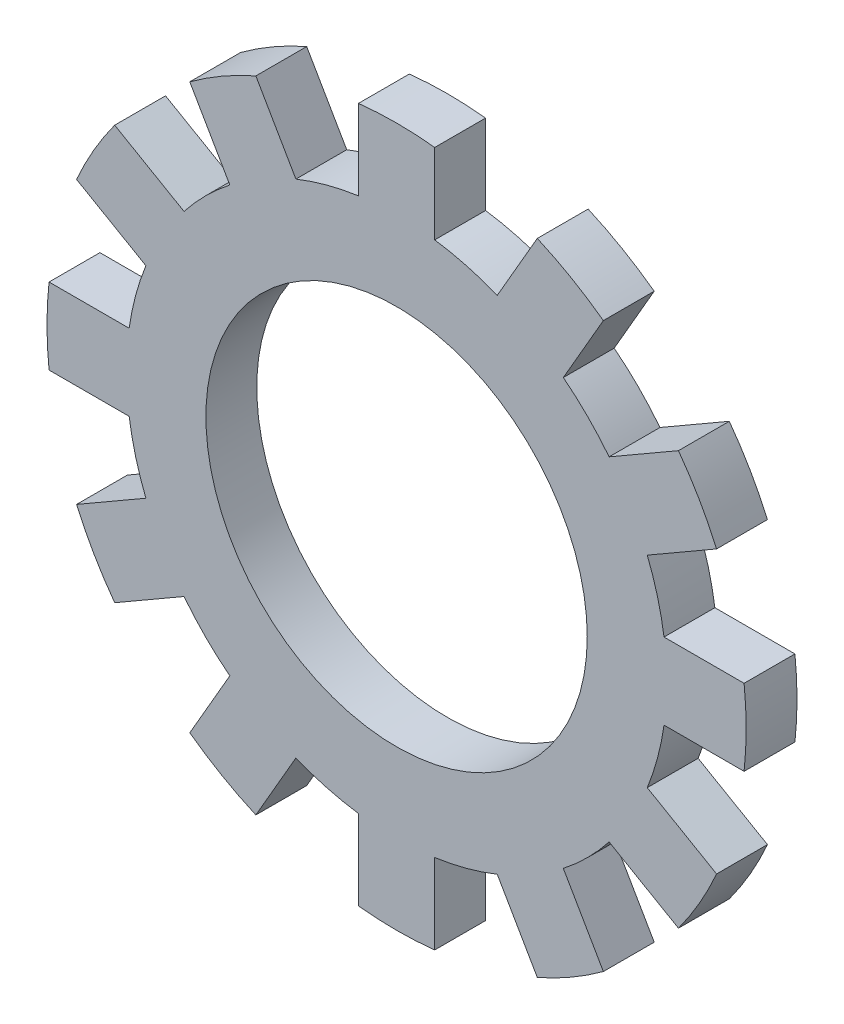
from build123d import *

# Parameters (mm, degrees)
SKETCH1_R                 = 2.125
SKETCH1_R_2               = 1.5
BOSS_EXTRUDE1_DEPTH       = 0.2
BOSS_EXTRUDE2_DEPTH       = 0.2
CIRPATTERN2_COUNT         = 12
CIRPATTERN2_COPY_1_DEPTH  = 0.2
CIRPATTERN2_COPY_2_DEPTH  = 0.2
CIRPATTERN2_COPY_3_DEPTH  = 0.2
CIRPATTERN2_COPY_4_DEPTH  = 0.2
CIRPATTERN2_COPY_5_DEPTH  = 0.2
CIRPATTERN2_COPY_6_DEPTH  = 0.2
CIRPATTERN2_COPY_7_DEPTH  = 0.2
CIRPATTERN2_COPY_8_DEPTH  = 0.2
CIRPATTERN2_COPY_9_DEPTH  = 0.2
CIRPATTERN2_COPY_10_DEPTH = 0.2
CIRPATTERN2_COPY_11_DEPTH = 0.2


with BuildPart() as part:
    # Sketch1 → Boss-Extrude1 (new, symmetric)
    with BuildSketch(Plane.XY):
        Circle(SKETCH1_R)
        Circle(SKETCH1_R_2, mode=Mode.SUBTRACT)
    extrude(amount=BOSS_EXTRUDE1_DEPTH, both=True)

    # Sketch3 → Boss-Extrude2 (add, symmetric)
    with BuildSketch(Plane.XY):
        with BuildLine():
            Line((-0.3, 2.733587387), (-0.3, 2.103716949))
            ThreePointArc((-0.3, 2.103716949), (-0.150377, 2.119672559), (0, 2.125))
            Line((0, 2.125), (0, 2.75))
            ThreePointArc((0, 2.75), (-0.150224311, 2.745893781), (-0.3, 2.733587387))
        make_face()
    boss_extrude2 = extrude(amount=BOSS_EXTRUDE2_DEPTH, both=True)

    # Mirror1: Boss-Extrude2 across plane
    add(boss_extrude2.mirror(Plane(origin=(0, 0, 0), x_dir=(0, 0, 1), z_dir=(1, 0, 0))))

    # CirPattern2: Boss-Extrude2 ×12 about axis
    cirpattern2_axis = Axis((0, 0, 0), (0, 0, 1))
    for i in range(1, CIRPATTERN2_COUNT):
        add(boss_extrude2.rotate(cirpattern2_axis, i * 360 / CIRPATTERN2_COUNT))

    # CirPattern2 copy 1 sketch → CirPattern2 copy 1 (add, symmetric)
    with BuildSketch(Plane(origin=(0, 0, 0), x_dir=(-0.8660254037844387, -0.49999999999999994, 0), z_dir=(0, 0, 1))):
        with BuildLine():
            Line((-0.3, -2.733587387), (-0.3, -2.103716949))
            ThreePointArc((-0.3, -2.103716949), (-0.150377, -2.119672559), (0, -2.125))
            Line((0, -2.125), (0, -2.75))
            ThreePointArc((0, -2.75), (-0.150224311, -2.745893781), (-0.3, -2.733587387))
        make_face()
    extrude(amount=CIRPATTERN2_COPY_1_DEPTH, both=True)

    # CirPattern2 copy 2 sketch → CirPattern2 copy 2 (add, symmetric)
    with BuildSketch(Plane(origin=(0, 0, 0), x_dir=(-0.5000000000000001, -0.8660254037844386, 0), z_dir=(0, 0, 1))):
        with BuildLine():
            Line((-0.3, -2.733587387), (-0.3, -2.103716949))
            ThreePointArc((-0.3, -2.103716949), (-0.150377, -2.119672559), (0, -2.125))
            Line((0, -2.125), (0, -2.75))
            ThreePointArc((0, -2.75), (-0.150224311, -2.745893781), (-0.3, -2.733587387))
        make_face()
    extrude(amount=CIRPATTERN2_COPY_2_DEPTH, both=True)

    # CirPattern2 copy 3 sketch → CirPattern2 copy 3 (add, symmetric)
    with BuildSketch(Plane(origin=(0, 0, 0), x_dir=(0, -1, 0), z_dir=(0, 0, 1))):
        with BuildLine():
            Line((-0.3, -2.733587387), (-0.3, -2.103716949))
            ThreePointArc((-0.3, -2.103716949), (-0.150377, -2.119672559), (0, -2.125))
            Line((0, -2.125), (0, -2.75))
            ThreePointArc((0, -2.75), (-0.150224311, -2.745893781), (-0.3, -2.733587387))
        make_face()
    extrude(amount=CIRPATTERN2_COPY_3_DEPTH, both=True)

    # CirPattern2 copy 4 sketch → CirPattern2 copy 4 (add, symmetric)
    with BuildSketch(Plane(origin=(0, 0, 0), x_dir=(0.4999999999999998, -0.8660254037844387, 0), z_dir=(0, 0, 1))):
        with BuildLine():
            Line((-0.3, -2.733587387), (-0.3, -2.103716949))
            ThreePointArc((-0.3, -2.103716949), (-0.150377, -2.119672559), (0, -2.125))
            Line((0, -2.125), (0, -2.75))
            ThreePointArc((0, -2.75), (-0.150224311, -2.745893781), (-0.3, -2.733587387))
        make_face()
    extrude(amount=CIRPATTERN2_COPY_4_DEPTH, both=True)

    # CirPattern2 copy 5 sketch → CirPattern2 copy 5 (add, symmetric)
    with BuildSketch(Plane(origin=(0, 0, 0), x_dir=(0.8660254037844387, -0.49999999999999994, 0), z_dir=(0, 0, 1))):
        with BuildLine():
            Line((-0.3, -2.733587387), (-0.3, -2.103716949))
            ThreePointArc((-0.3, -2.103716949), (-0.150377, -2.119672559), (0, -2.125))
            Line((0, -2.125), (0, -2.75))
            ThreePointArc((0, -2.75), (-0.150224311, -2.745893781), (-0.3, -2.733587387))
        make_face()
    extrude(amount=CIRPATTERN2_COPY_5_DEPTH, both=True)

    # CirPattern2 copy 6 sketch → CirPattern2 copy 6 (add, symmetric)
    with BuildSketch(Plane.XY):
        with BuildLine():
            Line((-0.3, -2.733587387), (-0.3, -2.103716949))
            ThreePointArc((-0.3, -2.103716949), (-0.150377, -2.119672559), (0, -2.125))
            Line((0, -2.125), (0, -2.75))
            ThreePointArc((0, -2.75), (-0.150224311, -2.745893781), (-0.3, -2.733587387))
        make_face()
    extrude(amount=CIRPATTERN2_COPY_6_DEPTH, both=True)

    # CirPattern2 copy 7 sketch → CirPattern2 copy 7 (add, symmetric)
    with BuildSketch(Plane(origin=(0, 0, 0), x_dir=(0.8660254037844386, 0.5000000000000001, 0), z_dir=(0, 0, 1))):
        with BuildLine():
            Line((-0.3, -2.733587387), (-0.3, -2.103716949))
            ThreePointArc((-0.3, -2.103716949), (-0.150377, -2.119672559), (0, -2.125))
            Line((0, -2.125), (0, -2.75))
            ThreePointArc((0, -2.75), (-0.150224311, -2.745893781), (-0.3, -2.733587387))
        make_face()
    extrude(amount=CIRPATTERN2_COPY_7_DEPTH, both=True)

    # CirPattern2 copy 8 sketch → CirPattern2 copy 8 (add, symmetric)
    with BuildSketch(Plane(origin=(0, 0, 0), x_dir=(0.5000000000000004, 0.8660254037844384, 0), z_dir=(0, 0, 1))):
        with BuildLine():
            Line((-0.3, -2.733587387), (-0.3, -2.103716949))
            ThreePointArc((-0.3, -2.103716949), (-0.150377, -2.119672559), (0, -2.125))
            Line((0, -2.125), (0, -2.75))
            ThreePointArc((0, -2.75), (-0.150224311, -2.745893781), (-0.3, -2.733587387))
        make_face()
    extrude(amount=CIRPATTERN2_COPY_8_DEPTH, both=True)

    # CirPattern2 copy 9 sketch → CirPattern2 copy 9 (add, symmetric)
    with BuildSketch(Plane(origin=(0, 0, 0), x_dir=(0, 1, 0), z_dir=(0, 0, 1))):
        with BuildLine():
            Line((-0.3, -2.733587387), (-0.3, -2.103716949))
            ThreePointArc((-0.3, -2.103716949), (-0.150377, -2.119672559), (0, -2.125))
            Line((0, -2.125), (0, -2.75))
            ThreePointArc((0, -2.75), (-0.150224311, -2.745893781), (-0.3, -2.733587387))
        make_face()
    extrude(amount=CIRPATTERN2_COPY_9_DEPTH, both=True)

    # CirPattern2 copy 10 sketch → CirPattern2 copy 10 (add, symmetric)
    with BuildSketch(Plane(origin=(0, 0, 0), x_dir=(-0.5000000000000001, 0.8660254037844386, 0), z_dir=(0, 0, 1))):
        with BuildLine():
            Line((-0.3, -2.733587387), (-0.3, -2.103716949))
            ThreePointArc((-0.3, -2.103716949), (-0.150377, -2.119672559), (0, -2.125))
            Line((0, -2.125), (0, -2.75))
            ThreePointArc((0, -2.75), (-0.150224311, -2.745893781), (-0.3, -2.733587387))
        make_face()
    extrude(amount=CIRPATTERN2_COPY_10_DEPTH, both=True)

    # CirPattern2 copy 11 sketch → CirPattern2 copy 11 (add, symmetric)
    with BuildSketch(Plane(origin=(0, 0, 0), x_dir=(-0.8660254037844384, 0.5000000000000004, 0), z_dir=(0, 0, 1))):
        with BuildLine():
            Line((-0.3, -2.733587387), (-0.3, -2.103716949))
            ThreePointArc((-0.3, -2.103716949), (-0.150377, -2.119672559), (0, -2.125))
            Line((0, -2.125), (0, -2.75))
            ThreePointArc((0, -2.75), (-0.150224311, -2.745893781), (-0.3, -2.733587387))
        make_face()
    extrude(amount=CIRPATTERN2_COPY_11_DEPTH, both=True)


solid = part.part
